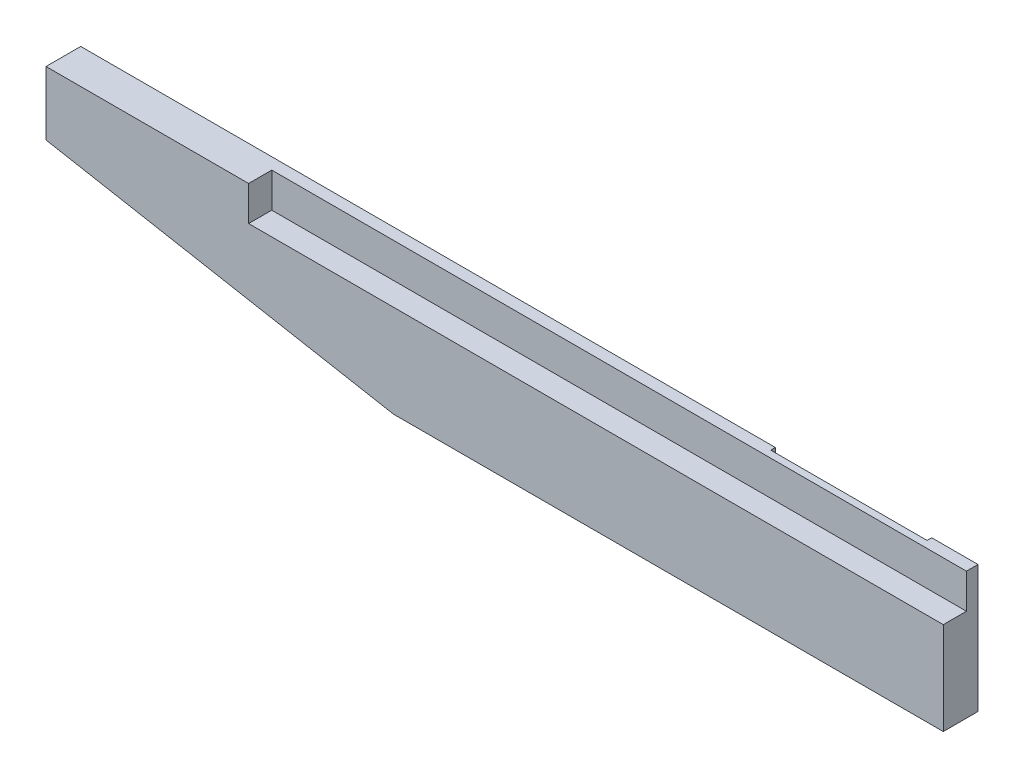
ISO-10303-21;
HEADER;
FILE_DESCRIPTION(('STEP AP214'),'2;1');
FILE_NAME('part.step','',(''),(''),'','','');
FILE_SCHEMA(('AUTOMOTIVE_DESIGN { 1 0 10303 214 1 1 1 1 }'));
ENDSEC;
DATA;
#1=APPLICATION_CONTEXT('core data for automotive mechanical design processes');
#2=APPLICATION_PROTOCOL_DEFINITION('international standard','automotive_design',2000,#1);
#3=PRODUCT_CONTEXT('',#1,'mechanical');
#4=PRODUCT('Part','Part','',(#3));
#5=PRODUCT_RELATED_PRODUCT_CATEGORY('part','',(#4));
#6=PRODUCT_DEFINITION_FORMATION('','',#4);
#7=PRODUCT_DEFINITION_CONTEXT('part definition',#1,'design');
#8=PRODUCT_DEFINITION('design','',#6,#7);
#9=PRODUCT_DEFINITION_SHAPE('','',#8);
#10=(LENGTH_UNIT() NAMED_UNIT(*) SI_UNIT(.MILLI.,.METRE.));
#11=(NAMED_UNIT(*) PLANE_ANGLE_UNIT() SI_UNIT($,.RADIAN.));
#12=(NAMED_UNIT(*) SI_UNIT($,.STERADIAN.) SOLID_ANGLE_UNIT());
#13=UNCERTAINTY_MEASURE_WITH_UNIT(LENGTH_MEASURE(1.E-05),#10,'distance_accuracy_value','');
#14=(GEOMETRIC_REPRESENTATION_CONTEXT(3) GLOBAL_UNCERTAINTY_ASSIGNED_CONTEXT((#13)) GLOBAL_UNIT_ASSIGNED_CONTEXT((#10,
#11,#12)) REPRESENTATION_CONTEXT('',''));
#15=CARTESIAN_POINT('',(0.,0.,0.));
#16=DIRECTION('',(0.,0.,1.));
#17=DIRECTION('',(1.,0.,0.));
#18=AXIS2_PLACEMENT_3D('',#15,#16,#17);
#19=CARTESIAN_POINT('',(-629.27680817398,69.85,0.));
#20=DIRECTION('',(0.,0.,1.));
#21=DIRECTION('',(1.,0.,0.));
#22=AXIS2_PLACEMENT_3D('',#19,#20,#21);
#23=PLANE('',#22);
#24=DIRECTION('',(1.,0.,0.));
#25=VECTOR('',#24,1.);
#26=CARTESIAN_POINT('',(-381.,50.8,0.));
#27=LINE('',#26,#25);
#28=CARTESIAN_POINT('',(-381.,50.8,0.));
#29=VERTEX_POINT('',#28);
#30=CARTESIAN_POINT('',(0.,50.8,0.));
#31=VERTEX_POINT('',#30);
#32=EDGE_CURVE('E140',#29,#31,#27,.T.);
#33=ORIENTED_EDGE('',*,*,#32,.F.);
#34=DIRECTION('',(0.,-1.,0.));
#35=VECTOR('',#34,1.);
#36=CARTESIAN_POINT('',(-381.,69.85,0.));
#37=LINE('',#36,#35);
#38=CARTESIAN_POINT('',(-381.,69.85,0.));
#39=VERTEX_POINT('',#38);
#40=EDGE_CURVE('E128',#39,#29,#37,.T.);
#41=ORIENTED_EDGE('',*,*,#40,.F.);
#42=DIRECTION('',(-1.,0.,0.));
#43=VECTOR('',#42,1.);
#44=CARTESIAN_POINT('',(-629.27680817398,69.85,0.));
#45=LINE('',#44,#43);
#46=CARTESIAN_POINT('',(-492.125,69.85,0.));
#47=VERTEX_POINT('',#46);
#48=EDGE_CURVE('E137',#39,#47,#45,.T.);
#49=ORIENTED_EDGE('',*,*,#48,.T.);
#50=DIRECTION('',(0.,-1.,0.));
#51=VECTOR('',#50,1.);
#52=CARTESIAN_POINT('',(-492.125,69.85,0.));
#53=LINE('',#52,#51);
#54=CARTESIAN_POINT('',(-492.125,34.925,0.));
#55=VERTEX_POINT('',#54);
#56=EDGE_CURVE('E169',#47,#55,#53,.T.);
#57=ORIENTED_EDGE('',*,*,#56,.T.);
#58=DIRECTION('',(0.983606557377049,-0.180327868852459,0.));
#59=VECTOR('',#58,1.);
#60=CARTESIAN_POINT('',(-631.011592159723,60.3875418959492,0.));
#61=LINE('',#60,#59);
#62=CARTESIAN_POINT('',(-301.625,0.,0.));
#63=VERTEX_POINT('',#62);
#64=EDGE_CURVE('E156',#55,#63,#61,.T.);
#65=ORIENTED_EDGE('',*,*,#64,.T.);
#66=DIRECTION('',(-1.,0.,0.));
#67=VECTOR('',#66,1.);
#68=CARTESIAN_POINT('',(-629.27680817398,0.,0.));
#69=LINE('',#68,#67);
#70=CARTESIAN_POINT('',(0.,0.,0.));
#71=VERTEX_POINT('',#70);
#72=EDGE_CURVE('E170',#71,#63,#69,.T.);
#73=ORIENTED_EDGE('',*,*,#72,.F.);
#74=DIRECTION('',(0.,-1.,0.));
#75=VECTOR('',#74,1.);
#76=CARTESIAN_POINT('',(0.,69.85,0.));
#77=LINE('',#76,#75);
#78=EDGE_CURVE('E42',#31,#71,#77,.T.);
#79=ORIENTED_EDGE('',*,*,#78,.F.);
#80=EDGE_LOOP('',(#33,#41,#49,#57,#65,#73,#79));
#81=FACE_BOUND('',#80,.T.);
#82=ADVANCED_FACE('F35',(#81),#23,.T.);
#83=CARTESIAN_POINT('',(-629.27680817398,69.85,-19.0500000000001));
#84=DIRECTION('',(0.,0.,1.));
#85=DIRECTION('',(1.,0.,0.));
#86=AXIS2_PLACEMENT_3D('',#83,#84,#85);
#87=PLANE('',#86);
#88=DIRECTION('',(0.983606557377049,-0.180327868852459,0.));
#89=VECTOR('',#88,1.);
#90=CARTESIAN_POINT('',(-631.011592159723,60.3875418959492,-19.0500000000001));
#91=LINE('',#90,#89);
#92=CARTESIAN_POINT('',(-492.125,34.925,-19.05));
#93=VERTEX_POINT('',#92);
#94=CARTESIAN_POINT('',(-301.625,0.,-19.05));
#95=VERTEX_POINT('',#94);
#96=EDGE_CURVE('E57',#93,#95,#91,.T.);
#97=ORIENTED_EDGE('',*,*,#96,.F.);
#98=DIRECTION('',(0.,-1.,0.));
#99=VECTOR('',#98,1.);
#100=CARTESIAN_POINT('',(-492.125,69.85,-19.05));
#101=LINE('',#100,#99);
#102=CARTESIAN_POINT('',(-492.125,69.85,-19.05));
#103=VERTEX_POINT('',#102);
#104=EDGE_CURVE('E183',#103,#93,#101,.T.);
#105=ORIENTED_EDGE('',*,*,#104,.F.);
#106=DIRECTION('',(-1.,0.,0.));
#107=VECTOR('',#106,1.);
#108=CARTESIAN_POINT('',(-629.27680817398,69.85,-19.0500000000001));
#109=LINE('',#108,#107);
#110=CARTESIAN_POINT('',(-111.125,69.85,-19.05));
#111=VERTEX_POINT('',#110);
#112=EDGE_CURVE('E166',#111,#103,#109,.T.);
#113=ORIENTED_EDGE('',*,*,#112,.F.);
#114=DIRECTION('',(0.,-1.,0.));
#115=VECTOR('',#114,1.);
#116=CARTESIAN_POINT('',(-111.125,69.85,-19.05));
#117=LINE('',#116,#115);
#118=CARTESIAN_POINT('',(-111.125,0.,-19.05));
#119=VERTEX_POINT('',#118);
#120=EDGE_CURVE('E185',#111,#119,#117,.T.);
#121=ORIENTED_EDGE('',*,*,#120,.T.);
#122=DIRECTION('',(-1.,0.,0.));
#123=VECTOR('',#122,1.);
#124=CARTESIAN_POINT('',(-629.27680817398,0.,-19.0500000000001));
#125=LINE('',#124,#123);
#126=EDGE_CURVE('E148',#119,#95,#125,.T.);
#127=ORIENTED_EDGE('',*,*,#126,.T.);
#128=EDGE_LOOP('',(#97,#105,#113,#121,#127));
#129=FACE_BOUND('',#128,.T.);
#130=ADVANCED_FACE('F241',(#129),#87,.F.);
#131=CARTESIAN_POINT('',(-492.125,69.85,-9.52520434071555));
#132=DIRECTION('',(-1.,0.,0.));
#133=DIRECTION('',(0.,0.,1.));
#134=AXIS2_PLACEMENT_3D('',#131,#132,#133);
#135=PLANE('',#134);
#136=ORIENTED_EDGE('',*,*,#104,.T.);
#137=DIRECTION('',(0.,0.,1.));
#138=VECTOR('',#137,1.);
#139=CARTESIAN_POINT('',(-492.125,34.925,-664.640370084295));
#140=LINE('',#139,#138);
#141=EDGE_CURVE('E231',#93,#55,#140,.T.);
#142=ORIENTED_EDGE('',*,*,#141,.T.);
#143=ORIENTED_EDGE('',*,*,#56,.F.);
#144=DIRECTION('',(0.,0.,-1.));
#145=VECTOR('',#144,1.);
#146=CARTESIAN_POINT('',(-492.125,69.85,-9.52520434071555));
#147=LINE('',#146,#145);
#148=EDGE_CURVE('E146',#47,#103,#147,.T.);
#149=ORIENTED_EDGE('',*,*,#148,.T.);
#150=EDGE_LOOP('',(#136,#142,#143,#149));
#151=FACE_BOUND('',#150,.T.);
#152=ADVANCED_FACE('F239',(#151),#135,.T.);
#153=CARTESIAN_POINT('',(-629.27680817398,0.,-9.52520434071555));
#154=DIRECTION('',(0.,1.,0.));
#155=DIRECTION('',(0.,0.,1.));
#156=AXIS2_PLACEMENT_3D('',#153,#154,#155);
#157=PLANE('',#156);
#158=DIRECTION('',(0.,0.,1.));
#159=VECTOR('',#158,1.);
#160=CARTESIAN_POINT('',(-301.625,0.,-9.52520434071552));
#161=LINE('',#160,#159);
#162=EDGE_CURVE('E11',#95,#63,#161,.T.);
#163=ORIENTED_EDGE('',*,*,#162,.F.);
#164=ORIENTED_EDGE('',*,*,#126,.F.);
#165=DIRECTION('',(0.,0.,-1.));
#166=VECTOR('',#165,1.);
#167=CARTESIAN_POINT('',(-111.125,0.,-9.52520434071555));
#168=LINE('',#167,#166);
#169=CARTESIAN_POINT('',(-111.125,0.,-16.51));
#170=VERTEX_POINT('',#169);
#171=EDGE_CURVE('E153',#170,#119,#168,.T.);
#172=ORIENTED_EDGE('',*,*,#171,.F.);
#173=DIRECTION('',(-1.,0.,0.));
#174=VECTOR('',#173,1.);
#175=CARTESIAN_POINT('',(-629.27680817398,0.,-16.51));
#176=LINE('',#175,#174);
#177=CARTESIAN_POINT('',(-25.4,0.,-16.51));
#178=VERTEX_POINT('',#177);
#179=EDGE_CURVE('E179',#178,#170,#176,.T.);
#180=ORIENTED_EDGE('',*,*,#179,.F.);
#181=DIRECTION('',(0.,0.,1.));
#182=VECTOR('',#181,1.);
#183=CARTESIAN_POINT('',(-25.4,0.,-9.52520434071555));
#184=LINE('',#183,#182);
#185=CARTESIAN_POINT('',(-25.4,0.,-19.05));
#186=VERTEX_POINT('',#185);
#187=EDGE_CURVE('E177',#186,#178,#184,.T.);
#188=ORIENTED_EDGE('',*,*,#187,.F.);
#189=DIRECTION('',(-1.,0.,0.));
#190=VECTOR('',#189,1.);
#191=CARTESIAN_POINT('',(-629.27680817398,0.,-19.0500000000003));
#192=LINE('',#191,#190);
#193=CARTESIAN_POINT('',(0.,0.,-19.05));
#194=VERTEX_POINT('',#193);
#195=EDGE_CURVE('E175',#194,#186,#192,.T.);
#196=ORIENTED_EDGE('',*,*,#195,.F.);
#197=DIRECTION('',(0.,0.,1.));
#198=VECTOR('',#197,1.);
#199=CARTESIAN_POINT('',(0.,0.,-9.52520434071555));
#200=LINE('',#199,#198);
#201=EDGE_CURVE('E172',#194,#71,#200,.T.);
#202=ORIENTED_EDGE('',*,*,#201,.T.);
#203=ORIENTED_EDGE('',*,*,#72,.T.);
#204=EDGE_LOOP('',(#163,#164,#172,#180,#188,#196,#202,#203));
#205=FACE_BOUND('',#204,.T.);
#206=ADVANCED_FACE('F210',(#205),#157,.F.);
#207=CARTESIAN_POINT('',(0.,69.85,-9.52520434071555));
#208=DIRECTION('',(1.,0.,0.));
#209=DIRECTION('',(0.,0.,-1.));
#210=AXIS2_PLACEMENT_3D('',#207,#208,#209);
#211=PLANE('',#210);
#212=DIRECTION('',(0.,1.,0.));
#213=VECTOR('',#212,1.);
#214=CARTESIAN_POINT('',(0.,69.85,-12.7));
#215=LINE('',#214,#213);
#216=CARTESIAN_POINT('',(0.,50.8,-12.7));
#217=VERTEX_POINT('',#216);
#218=CARTESIAN_POINT('',(0.,69.85,-12.7));
#219=VERTEX_POINT('',#218);
#220=EDGE_CURVE('E133',#217,#219,#215,.T.);
#221=ORIENTED_EDGE('',*,*,#220,.F.);
#222=DIRECTION('',(0.,0.,-1.));
#223=VECTOR('',#222,1.);
#224=CARTESIAN_POINT('',(0.,50.8,0.));
#225=LINE('',#224,#223);
#226=EDGE_CURVE('E205',#31,#217,#225,.T.);
#227=ORIENTED_EDGE('',*,*,#226,.F.);
#228=ORIENTED_EDGE('',*,*,#78,.T.);
#229=ORIENTED_EDGE('',*,*,#201,.F.);
#230=DIRECTION('',(0.,-1.,0.));
#231=VECTOR('',#230,1.);
#232=CARTESIAN_POINT('',(0.,69.85,-19.05));
#233=LINE('',#232,#231);
#234=CARTESIAN_POINT('',(0.,69.85,-19.05));
#235=VERTEX_POINT('',#234);
#236=EDGE_CURVE('E197',#235,#194,#233,.T.);
#237=ORIENTED_EDGE('',*,*,#236,.F.);
#238=DIRECTION('',(0.,0.,1.));
#239=VECTOR('',#238,1.);
#240=CARTESIAN_POINT('',(0.,69.85,-9.52520434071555));
#241=LINE('',#240,#239);
#242=EDGE_CURVE('E147',#235,#219,#241,.T.);
#243=ORIENTED_EDGE('',*,*,#242,.T.);
#244=EDGE_LOOP('',(#221,#227,#228,#229,#237,#243));
#245=FACE_BOUND('',#244,.T.);
#246=ADVANCED_FACE('F203',(#245),#211,.T.);
#247=CARTESIAN_POINT('',(-629.27680817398,69.85,-19.0500000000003));
#248=DIRECTION('',(0.,0.,1.));
#249=DIRECTION('',(1.,0.,0.));
#250=AXIS2_PLACEMENT_3D('',#247,#248,#249);
#251=PLANE('',#250);
#252=ORIENTED_EDGE('',*,*,#195,.T.);
#253=DIRECTION('',(0.,-1.,0.));
#254=VECTOR('',#253,1.);
#255=CARTESIAN_POINT('',(-25.4,69.85,-19.05));
#256=LINE('',#255,#254);
#257=CARTESIAN_POINT('',(-25.4,69.85,-19.05));
#258=VERTEX_POINT('',#257);
#259=EDGE_CURVE('E194',#258,#186,#256,.T.);
#260=ORIENTED_EDGE('',*,*,#259,.F.);
#261=DIRECTION('',(-1.,0.,0.));
#262=VECTOR('',#261,1.);
#263=CARTESIAN_POINT('',(-629.27680817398,69.85,-19.0500000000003));
#264=LINE('',#263,#262);
#265=EDGE_CURVE('E151',#235,#258,#264,.T.);
#266=ORIENTED_EDGE('',*,*,#265,.F.);
#267=ORIENTED_EDGE('',*,*,#236,.T.);
#268=EDGE_LOOP('',(#252,#260,#266,#267));
#269=FACE_BOUND('',#268,.T.);
#270=ADVANCED_FACE('F215',(#269),#251,.F.);
#271=CARTESIAN_POINT('',(-25.4,69.85,-9.52520434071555));
#272=DIRECTION('',(1.,0.,0.));
#273=DIRECTION('',(0.,0.,-1.));
#274=AXIS2_PLACEMENT_3D('',#271,#272,#273);
#275=PLANE('',#274);
#276=ORIENTED_EDGE('',*,*,#187,.T.);
#277=DIRECTION('',(0.,-1.,0.));
#278=VECTOR('',#277,1.);
#279=CARTESIAN_POINT('',(-25.4,69.85,-16.51));
#280=LINE('',#279,#278);
#281=CARTESIAN_POINT('',(-25.4,69.85,-16.51));
#282=VERTEX_POINT('',#281);
#283=EDGE_CURVE('E191',#282,#178,#280,.T.);
#284=ORIENTED_EDGE('',*,*,#283,.F.);
#285=DIRECTION('',(0.,0.,1.));
#286=VECTOR('',#285,1.);
#287=CARTESIAN_POINT('',(-25.4,69.85,-9.52520434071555));
#288=LINE('',#287,#286);
#289=EDGE_CURVE('E160',#258,#282,#288,.T.);
#290=ORIENTED_EDGE('',*,*,#289,.F.);
#291=ORIENTED_EDGE('',*,*,#259,.T.);
#292=EDGE_LOOP('',(#276,#284,#290,#291));
#293=FACE_BOUND('',#292,.T.);
#294=ADVANCED_FACE('F219',(#293),#275,.F.);
#295=CARTESIAN_POINT('',(-629.27680817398,69.85,-16.51));
#296=DIRECTION('',(0.,0.,1.));
#297=DIRECTION('',(1.,0.,0.));
#298=AXIS2_PLACEMENT_3D('',#295,#296,#297);
#299=PLANE('',#298);
#300=ORIENTED_EDGE('',*,*,#179,.T.);
#301=DIRECTION('',(0.,-1.,0.));
#302=VECTOR('',#301,1.);
#303=CARTESIAN_POINT('',(-111.125,69.85,-16.51));
#304=LINE('',#303,#302);
#305=CARTESIAN_POINT('',(-111.125,69.85,-16.51));
#306=VERTEX_POINT('',#305);
#307=EDGE_CURVE('E188',#306,#170,#304,.T.);
#308=ORIENTED_EDGE('',*,*,#307,.F.);
#309=DIRECTION('',(-1.,0.,0.));
#310=VECTOR('',#309,1.);
#311=CARTESIAN_POINT('',(-629.27680817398,69.85,-16.51));
#312=LINE('',#311,#310);
#313=EDGE_CURVE('E162',#282,#306,#312,.T.);
#314=ORIENTED_EDGE('',*,*,#313,.F.);
#315=ORIENTED_EDGE('',*,*,#283,.T.);
#316=EDGE_LOOP('',(#300,#308,#314,#315));
#317=FACE_BOUND('',#316,.T.);
#318=ADVANCED_FACE('F249',(#317),#299,.F.);
#319=CARTESIAN_POINT('',(-111.125,69.85,-9.52520434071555));
#320=DIRECTION('',(-1.,0.,0.));
#321=DIRECTION('',(0.,0.,1.));
#322=AXIS2_PLACEMENT_3D('',#319,#320,#321);
#323=PLANE('',#322);
#324=ORIENTED_EDGE('',*,*,#171,.T.);
#325=ORIENTED_EDGE('',*,*,#120,.F.);
#326=DIRECTION('',(0.,0.,-1.));
#327=VECTOR('',#326,1.);
#328=CARTESIAN_POINT('',(-111.125,69.85,-9.52520434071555));
#329=LINE('',#328,#327);
#330=EDGE_CURVE('E164',#306,#111,#329,.T.);
#331=ORIENTED_EDGE('',*,*,#330,.F.);
#332=ORIENTED_EDGE('',*,*,#307,.T.);
#333=EDGE_LOOP('',(#324,#325,#331,#332));
#334=FACE_BOUND('',#333,.T.);
#335=ADVANCED_FACE('F246',(#334),#323,.F.);
#336=CARTESIAN_POINT('',(-629.27680817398,69.85,-9.52520434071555));
#337=DIRECTION('',(0.,1.,0.));
#338=DIRECTION('',(0.,0.,1.));
#339=AXIS2_PLACEMENT_3D('',#336,#337,#338);
#340=PLANE('',#339);
#341=DIRECTION('',(1.,0.,0.));
#342=VECTOR('',#341,1.);
#343=CARTESIAN_POINT('',(-381.,69.85,-12.7));
#344=LINE('',#343,#342);
#345=CARTESIAN_POINT('',(-381.,69.85,-12.7));
#346=VERTEX_POINT('',#345);
#347=EDGE_CURVE('E224',#346,#219,#344,.T.);
#348=ORIENTED_EDGE('',*,*,#347,.T.);
#349=ORIENTED_EDGE('',*,*,#242,.F.);
#350=ORIENTED_EDGE('',*,*,#265,.T.);
#351=ORIENTED_EDGE('',*,*,#289,.T.);
#352=ORIENTED_EDGE('',*,*,#313,.T.);
#353=ORIENTED_EDGE('',*,*,#330,.T.);
#354=ORIENTED_EDGE('',*,*,#112,.T.);
#355=ORIENTED_EDGE('',*,*,#148,.F.);
#356=ORIENTED_EDGE('',*,*,#48,.F.);
#357=DIRECTION('',(0.,0.,1.));
#358=VECTOR('',#357,1.);
#359=CARTESIAN_POINT('',(-381.,69.85,0.));
#360=LINE('',#359,#358);
#361=EDGE_CURVE('E125',#346,#39,#360,.T.);
#362=ORIENTED_EDGE('',*,*,#361,.F.);
#363=EDGE_LOOP('',(#348,#349,#350,#351,#352,#353,#354,#355,#356,#362));
#364=FACE_BOUND('',#363,.T.);
#365=ADVANCED_FACE('F144',(#364),#340,.T.);
#366=CARTESIAN_POINT('',(-492.125,34.925,-664.640370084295));
#367=DIRECTION('',(-0.180327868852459,-0.983606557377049,0.));
#368=DIRECTION('',(0.983606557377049,-0.180327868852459,0.));
#369=AXIS2_PLACEMENT_3D('',#366,#367,#368);
#370=PLANE('',#369);
#371=ORIENTED_EDGE('',*,*,#64,.F.);
#372=ORIENTED_EDGE('',*,*,#141,.F.);
#373=ORIENTED_EDGE('',*,*,#96,.T.);
#374=ORIENTED_EDGE('',*,*,#162,.T.);
#375=EDGE_LOOP('',(#371,#372,#373,#374));
#376=FACE_BOUND('',#375,.T.);
#377=ADVANCED_FACE('F237',(#376),#370,.T.);
#378=CARTESIAN_POINT('',(-381.,69.85,-12.7));
#379=DIRECTION('',(0.,0.,-1.));
#380=DIRECTION('',(-1.,0.,0.));
#381=AXIS2_PLACEMENT_3D('',#378,#379,#380);
#382=PLANE('',#381);
#383=ORIENTED_EDGE('',*,*,#220,.T.);
#384=ORIENTED_EDGE('',*,*,#347,.F.);
#385=DIRECTION('',(0.,1.,0.));
#386=VECTOR('',#385,1.);
#387=CARTESIAN_POINT('',(-381.,69.85,-12.7));
#388=LINE('',#387,#386);
#389=CARTESIAN_POINT('',(-381.,50.8,-12.7));
#390=VERTEX_POINT('',#389);
#391=EDGE_CURVE('E49',#390,#346,#388,.T.);
#392=ORIENTED_EDGE('',*,*,#391,.F.);
#393=DIRECTION('',(1.,0.,0.));
#394=VECTOR('',#393,1.);
#395=CARTESIAN_POINT('',(-381.,50.8,-12.7));
#396=LINE('',#395,#394);
#397=EDGE_CURVE('E232',#390,#217,#396,.T.);
#398=ORIENTED_EDGE('',*,*,#397,.T.);
#399=EDGE_LOOP('',(#383,#384,#392,#398));
#400=FACE_BOUND('',#399,.T.);
#401=ADVANCED_FACE('F274',(#400),#382,.F.);
#402=CARTESIAN_POINT('',(-381.,50.8,0.));
#403=DIRECTION('',(0.,-1.,0.));
#404=DIRECTION('',(0.,0.,-1.));
#405=AXIS2_PLACEMENT_3D('',#402,#403,#404);
#406=PLANE('',#405);
#407=ORIENTED_EDGE('',*,*,#226,.T.);
#408=ORIENTED_EDGE('',*,*,#397,.F.);
#409=DIRECTION('',(0.,0.,-1.));
#410=VECTOR('',#409,1.);
#411=CARTESIAN_POINT('',(-381.,50.8,0.));
#412=LINE('',#411,#410);
#413=EDGE_CURVE('E141',#29,#390,#412,.T.);
#414=ORIENTED_EDGE('',*,*,#413,.F.);
#415=ORIENTED_EDGE('',*,*,#32,.T.);
#416=EDGE_LOOP('',(#407,#408,#414,#415));
#417=FACE_BOUND('',#416,.T.);
#418=ADVANCED_FACE('F275',(#417),#406,.F.);
#419=CARTESIAN_POINT('',(-381.,69.85,-12.7));
#420=DIRECTION('',(-1.,0.,0.));
#421=DIRECTION('',(0.,0.,1.));
#422=AXIS2_PLACEMENT_3D('',#419,#420,#421);
#423=PLANE('',#422);
#424=ORIENTED_EDGE('',*,*,#361,.T.);
#425=ORIENTED_EDGE('',*,*,#40,.T.);
#426=ORIENTED_EDGE('',*,*,#413,.T.);
#427=ORIENTED_EDGE('',*,*,#391,.T.);
#428=EDGE_LOOP('',(#424,#425,#426,#427));
#429=FACE_BOUND('',#428,.T.);
#430=ADVANCED_FACE('F127',(#429),#423,.F.);
#431=CLOSED_SHELL('',(#82,#130,#152,#206,#246,#270,#294,#318,#335,#365,#377,#401,#418,#430));
#432=MANIFOLD_SOLID_BREP('B2',#431);
#433=ADVANCED_BREP_SHAPE_REPRESENTATION('',(#18,#432),#14);
#434=SHAPE_DEFINITION_REPRESENTATION(#9,#433);
ENDSEC;
END-ISO-10303-21;
